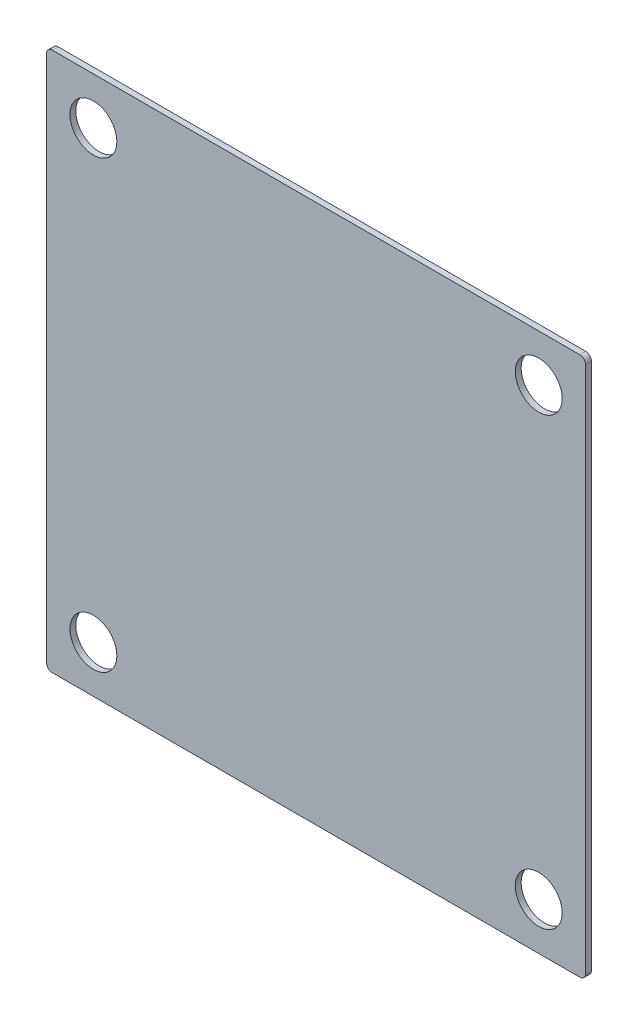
from build123d import *

# Parameters (mm, degrees)
SKETCH1_R           = 6.35
BOSS_EXTRUDE1_DEPTH = 1.5875


with BuildPart() as part:
    # Sketch1 → Boss-Extrude1 (new body)
    with BuildSketch(Plane.XY):
        with BuildLine():
            Line((-71.4375, 73.025), (71.4375, 73.025))
            ThreePointArc((71.4375, 73.025), (72.560032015, 72.560032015), (73.025, 71.4375))
            Line((73.025, 71.4375), (73.025, -71.4375))
            ThreePointArc((73.025, -71.4375), (72.560032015, -72.560032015), (71.4375, -73.025))
            Line((71.4375, -73.025), (-71.4375, -73.025))
            ThreePointArc((-71.4375, -73.025), (-72.560032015, -72.560032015), (-73.025, -71.4375))
            Line((-73.025, -71.4375), (-73.025, 71.4375))
            ThreePointArc((-73.025, 71.4375), (-72.560032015, 72.560032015), (-71.4375, 73.025))
        make_face()
        with Locations((-60.325, -60.325)):
            Circle(SKETCH1_R, mode=Mode.SUBTRACT)
        with Locations((60.325, -60.325)):
            Circle(SKETCH1_R, mode=Mode.SUBTRACT)
        with Locations((60.325, 60.325)):
            Circle(SKETCH1_R, mode=Mode.SUBTRACT)
        with Locations((-60.325, 60.325)):
            Circle(SKETCH1_R, mode=Mode.SUBTRACT)
    extrude(amount=BOSS_EXTRUDE1_DEPTH)


solid = part.part
